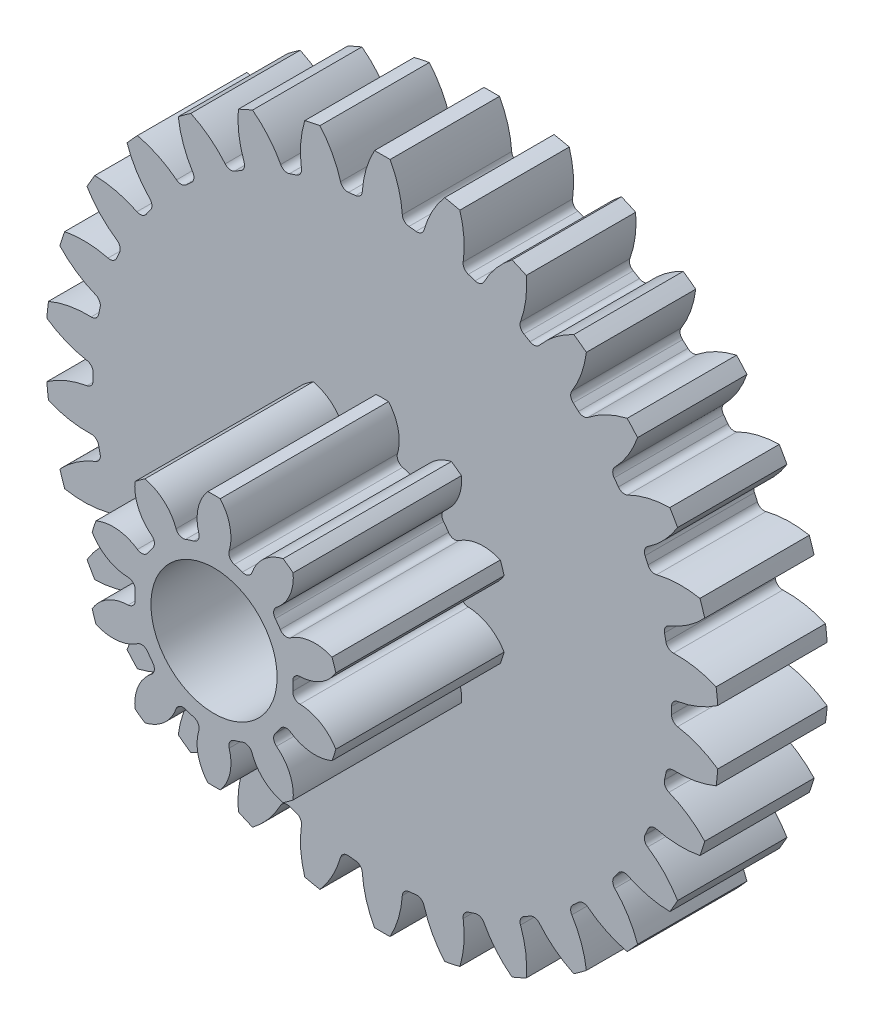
from build123d import *

# Parameters (mm, degrees)
BOSS_EXTRU_1_DEPTH                 = 2.6
CONG_1_R                           = 0.175
R_P_TITION_CIRCULAIRE4_COUNT       = 30
CONG_1_OF_R_P_TITION_CIRCULAIRE4_R = 0.175
BOSS_EXTRU_2_DEPTH                 = 4
CONG_2_R                           = 0.175
R_P_TITION_CIRCULAIRE5_COUNT       = 10
CONG_2_OF_R_P_TITION_CIRCULAIRE5_R = 0.175
ESQUISSE10_R                       = 1.5
ENL_V_MAT_EXTRU_4_DEPTH            = 15.293363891


with BuildPart() as part:
    # Esquisse3 → Boss.-Extru.1 (new body)
    with BuildSketch(Plane.XY):
        with BuildLine():
            Line((-2.097340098, 6.276985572), (-1.378706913, -0.560352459))
            Line((-1.378706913, -0.560352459), (-0.660073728, 6.276985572))
            ThreePointArc((-0.660073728, 6.276985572), (-0.778877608, 6.288430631), (-0.897862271, 6.29781154))
            ThreePointArc((-0.897862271, 6.29781154), (-0.974546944, 6.88628764), (-1.194373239, 7.437523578))
            ThreePointArc((-1.194373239, 7.437523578), (-1.378706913, 7.439647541), (-1.563040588, 7.437523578))
            ThreePointArc((-1.563040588, 7.437523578), (-1.782866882, 6.88628764), (-1.859551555, 6.29781154))
            ThreePointArc((-1.859551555, 6.29781154), (-1.978536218, 6.288430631), (-2.097340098, 6.276985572))
        make_face()
    boss_extru_1 = extrude(amount=BOSS_EXTRU_1_DEPTH)

    # Cong_1
    cong_1_edges = [part.edges().sort_by_distance(p)[0] for p in [
        (-1.859551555, 6.29781154, 1.3),
        (-0.897862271, 6.29781154, 1.3),
    ]]
    fillet(cong_1_edges, radius=CONG_1_R)

    # R_p_tition circulaire4: Boss.-Extru.1 ×30 about axis
    r_p_tition_circulaire4_axis = Axis((-1.378706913, -0.560352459, 0), (0, 0, 1))
    for i in range(1, R_P_TITION_CIRCULAIRE4_COUNT):
        add(boss_extru_1.rotate(r_p_tition_circulaire4_axis, i * 360 / R_P_TITION_CIRCULAIRE4_COUNT))

    # Cong_1 of R_p_tition circulaire4
    cong_1_of_r_p_tition_circulaire4_edges = [part.edges().sort_by_distance(p)[0] for p in [
        (-3.274936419, 6.047970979, 1.3),
        (-2.334262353, 6.247917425, 1.3),
        (-4.607446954, 5.509314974, 1.3),
        (-3.728900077, 5.900469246, 1.3),
        (-5.798846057, 4.705385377, 1.3),
        (-5.020823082, 5.270652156, 1.3),
        (-6.797063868, 3.671317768, 1.3),
        (-6.153568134, 4.385992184, 1.3),
        (-7.55847348, 2.452305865, 1.3),
        (-7.077628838, 3.285153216, 1.3),
        (-8.04979764, 1.101626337, 1.3),
        (-7.752619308, 2.016247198, 1.3),
        (-8.249563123, -0.32168964, 1.3),
        (-8.14903922, 0.63473141, 1.3),
        (-8.14903922, -1.755436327, 1.3),
        (-8.249563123, -0.799015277, 1.3),
        (-7.752619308, -3.136952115, 1.3),
        (-8.04979764, -2.222331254, 1.3),
        (-7.077628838, -4.405858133, 1.3),
        (-7.55847348, -3.573010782, 1.3),
        (-6.153568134, -5.506697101, 1.3),
        (-6.797063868, -4.792022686, 1.3),
        (-5.020823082, -6.391357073, 1.3),
        (-5.798846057, -5.826090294, 1.3),
        (-3.728900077, -7.021174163, 1.3),
        (-4.607446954, -6.630019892, 1.3),
        (-2.334262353, -7.368622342, 1.3),
        (-3.274936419, -7.168675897, 1.3),
        (-0.897862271, -7.418516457, 1.3),
        (-1.859551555, -7.418516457, 1.3),
        (0.517522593, -7.168675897, 1.3),
        (-0.423151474, -7.368622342, 1.3),
        (1.850033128, -6.630019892, 1.3),
        (0.97148625, -7.021174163, 1.3),
        (3.04143223, -5.826090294, 1.3),
        (2.263409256, -6.391357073, 1.3),
        (4.039650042, -4.792022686, 1.3),
        (3.396154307, -5.506697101, 1.3),
        (4.801059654, -3.573010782, 1.3),
        (4.320215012, -4.405858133, 1.3),
        (5.292383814, -2.222331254, 1.3),
        (4.995205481, -3.136952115, 1.3),
        (5.492149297, -0.799015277, 1.3),
        (5.391625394, -1.755436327, 1.3),
        (5.391625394, 0.63473141, 1.3),
        (5.492149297, -0.32168964, 1.3),
        (4.995205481, 2.016247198, 1.3),
        (5.292383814, 1.101626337, 1.3),
        (4.320215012, 3.285153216, 1.3),
        (4.801059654, 2.452305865, 1.3),
        (3.396154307, 4.385992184, 1.3),
        (4.039650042, 3.671317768, 1.3),
        (2.263409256, 5.270652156, 1.3),
        (3.04143223, 4.705385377, 1.3),
        (0.97148625, 5.900469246, 1.3),
        (1.850033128, 5.509314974, 1.3),
        (-0.423151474, 6.247917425, 1.3),
        (0.517522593, 6.047970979, 1.3),
    ]]
    fillet(cong_1_of_r_p_tition_circulaire4_edges, radius=CONG_1_OF_R_P_TITION_CIRCULAIRE4_R)

    # Esquisse8 → Boss.-Extru.2 (add)
    with BuildSketch(Plane.XY.offset(2.6)):
        with BuildLine():
            Line((-1.958113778, 1.222878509), (-1.378706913, -0.560352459))
            Line((-1.378706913, -0.560352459), (-0.799300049, 1.222878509))
            ThreePointArc((-0.799300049, 1.222878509), (-0.942925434, 1.263303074), (-1.089310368, 1.292179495))
            ThreePointArc((-1.089310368, 1.292179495), (-0.984517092, 1.886051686), (-1.231837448, 2.436050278))
            ThreePointArc((-1.231837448, 2.436050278), (-1.378706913, 2.439647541), (-1.525576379, 2.436050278))
            ThreePointArc((-1.525576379, 2.436050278), (-1.772896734, 1.886051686), (-1.668103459, 1.292179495))
            ThreePointArc((-1.668103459, 1.292179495), (-1.814488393, 1.263303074), (-1.958113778, 1.222878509))
        make_face()
    boss_extru_2 = extrude(amount=BOSS_EXTRU_2_DEPTH)

    # Cong_2
    cong_2_edges = [part.edges().sort_by_distance(p)[0] for p in [
        (-1.089310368, 1.292179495, 4.6),
        (-1.668103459, 1.292179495, 4.6),
    ]]
    fillet(cong_2_edges, radius=CONG_2_R)

    # R_p_tition circulaire5: Boss.-Extru.2 ×10 about axis
    r_p_tition_circulaire5_axis = Axis((-1.378706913, -0.560352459, 0), (0, 0, 1))
    for i in range(1, R_P_TITION_CIRCULAIRE5_COUNT):
        add(boss_extru_2.rotate(r_p_tition_circulaire5_axis, i * 360 / R_P_TITION_CIRCULAIRE5_COUNT))

    # Cong_2 of R_p_tition circulaire5
    cong_2_of_r_p_tition_circulaire5_edges = [part.edges().sort_by_distance(p)[0] for p in [
        (-2.233471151, 1.108480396, 4.6),
        (-2.701724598, 0.768274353, 4.6),
        (-3.051141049, 0.287343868, 4.6),
        (-3.22999795, -0.263121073, 4.6),
        (-3.22999795, -0.857583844, 4.6),
        (-3.051141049, -1.408048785, 4.6),
        (-2.701724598, -1.88897927, 4.6),
        (-2.233471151, -2.229185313, 4.6),
        (-1.668103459, -2.412884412, 4.6),
        (-1.089310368, -2.412884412, 4.6),
        (-0.523942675, -2.229185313, 4.6),
        (-0.055689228, -1.88897927, 4.6),
        (0.293727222, -1.408048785, 4.6),
        (0.472584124, -0.857583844, 4.6),
        (0.472584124, -0.263121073, 4.6),
        (0.293727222, 0.287343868, 4.6),
        (-0.055689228, 0.768274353, 4.6),
        (-0.523942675, 1.108480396, 4.6),
    ]]
    fillet(cong_2_of_r_p_tition_circulaire5_edges, radius=CONG_2_OF_R_P_TITION_CIRCULAIRE5_R)

    # Esquisse10 → Enl_v. mat.-Extru.4 (cut, through all)
    with BuildSketch(Plane.XY):
        with Locations((-1.378706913, -0.560352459)):
            Circle(ESQUISSE10_R)
    extrude(amount=ENL_V_MAT_EXTRU_4_DEPTH, mode=Mode.SUBTRACT)


solid = part.part
